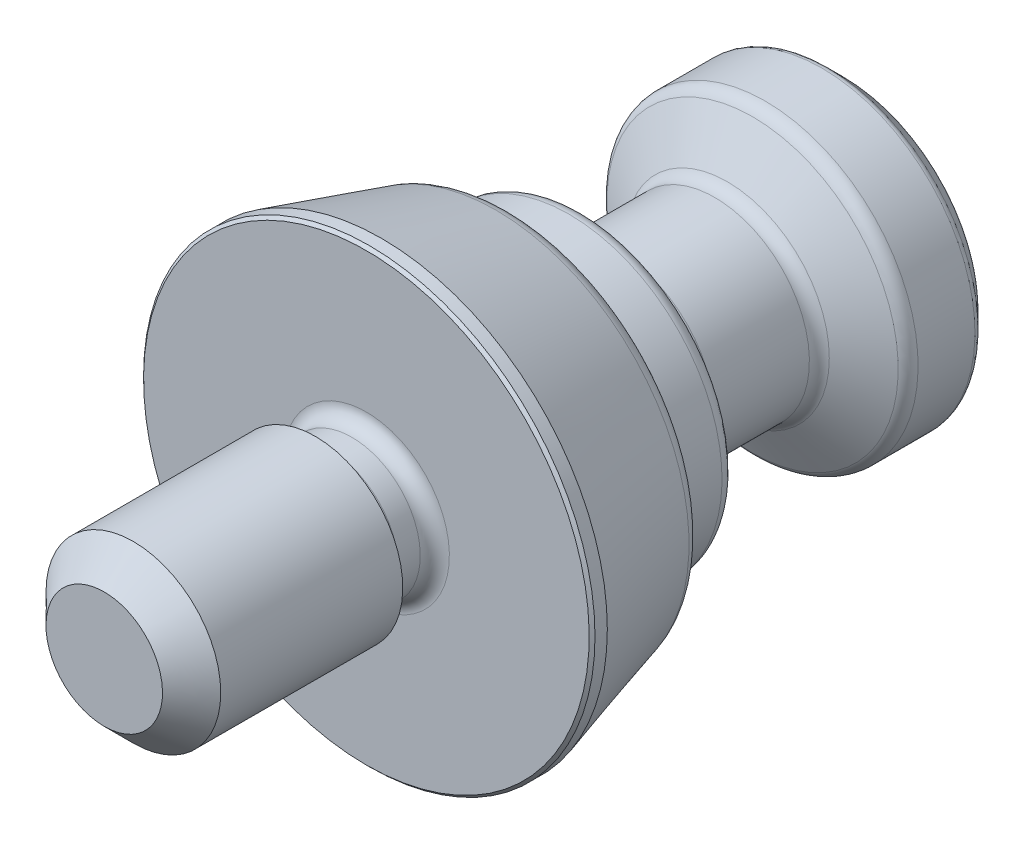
ISO-10303-21;
HEADER;
FILE_DESCRIPTION(('STEP AP214'),'2;1');
FILE_NAME('part.step','',(''),(''),'','','');
FILE_SCHEMA(('AUTOMOTIVE_DESIGN { 1 0 10303 214 1 1 1 1 }'));
ENDSEC;
DATA;
#1=APPLICATION_CONTEXT('core data for automotive mechanical design processes');
#2=APPLICATION_PROTOCOL_DEFINITION('international standard','automotive_design',2000,#1);
#3=PRODUCT_CONTEXT('',#1,'mechanical');
#4=PRODUCT('Part','Part','',(#3));
#5=PRODUCT_RELATED_PRODUCT_CATEGORY('part','',(#4));
#6=PRODUCT_DEFINITION_FORMATION('','',#4);
#7=PRODUCT_DEFINITION_CONTEXT('part definition',#1,'design');
#8=PRODUCT_DEFINITION('design','',#6,#7);
#9=PRODUCT_DEFINITION_SHAPE('','',#8);
#10=(LENGTH_UNIT() NAMED_UNIT(*) SI_UNIT(.MILLI.,.METRE.));
#11=(NAMED_UNIT(*) PLANE_ANGLE_UNIT() SI_UNIT($,.RADIAN.));
#12=(NAMED_UNIT(*) SI_UNIT($,.STERADIAN.) SOLID_ANGLE_UNIT());
#13=UNCERTAINTY_MEASURE_WITH_UNIT(LENGTH_MEASURE(1.E-05),#10,'distance_accuracy_value','');
#14=(GEOMETRIC_REPRESENTATION_CONTEXT(3) GLOBAL_UNCERTAINTY_ASSIGNED_CONTEXT((#13)) GLOBAL_UNIT_ASSIGNED_CONTEXT((#10,
#11,#12)) REPRESENTATION_CONTEXT('',''));
#15=CARTESIAN_POINT('',(0.,0.,0.));
#16=DIRECTION('',(0.,0.,1.));
#17=DIRECTION('',(1.,0.,0.));
#18=AXIS2_PLACEMENT_3D('',#15,#16,#17);
#19=CARTESIAN_POINT('',(3.46410161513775,0.,-28.5));
#20=DIRECTION('',(0.,0.,-1.));
#21=DIRECTION('',(0.,1.,0.));
#22=AXIS2_PLACEMENT_3D('',#19,#20,#21);
#23=PLANE('',#22);
#24=DIRECTION('',(-1.,0.,0.));
#25=VECTOR('',#24,1.);
#26=CARTESIAN_POINT('',(1.73205080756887,-3.,-28.5));
#27=LINE('',#26,#25);
#28=CARTESIAN_POINT('',(1.73205080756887,-3.,-28.5));
#29=VERTEX_POINT('',#28);
#30=CARTESIAN_POINT('',(0.,-3.,-28.5));
#31=VERTEX_POINT('',#30);
#32=EDGE_CURVE('E216',#29,#31,#27,.T.);
#33=ORIENTED_EDGE('',*,*,#32,.T.);
#34=CARTESIAN_POINT('',(0.,0.,-28.5));
#35=DIRECTION('',(0.,0.,1.));
#36=DIRECTION('',(0.,-1.,0.));
#37=AXIS2_PLACEMENT_3D('',#34,#35,#36);
#38=CIRCLE('',#37,3.);
#39=CARTESIAN_POINT('',(2.59807621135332,-1.5,-28.5));
#40=VERTEX_POINT('',#39);
#41=EDGE_CURVE('E29',#31,#40,#38,.T.);
#42=ORIENTED_EDGE('',*,*,#41,.T.);
#43=DIRECTION('',(-0.5,-0.866025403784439,0.));
#44=VECTOR('',#43,1.);
#45=CARTESIAN_POINT('',(3.46410161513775,0.,-28.5));
#46=LINE('',#45,#44);
#47=EDGE_CURVE('E440',#40,#29,#46,.T.);
#48=ORIENTED_EDGE('',*,*,#47,.T.);
#49=EDGE_LOOP('',(#33,#42,#48));
#50=FACE_BOUND('',#49,.T.);
#51=ADVANCED_FACE('F14',(#50),#23,.T.);
#52=CARTESIAN_POINT('',(3.46410161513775,0.,-28.5));
#53=VERTEX_POINT('',#52);
#54=EDGE_CURVE('E441',#53,#40,#46,.T.);
#55=ORIENTED_EDGE('',*,*,#54,.T.);
#56=CARTESIAN_POINT('',(2.59807621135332,1.5,-28.5));
#57=VERTEX_POINT('',#56);
#58=EDGE_CURVE('E103',#40,#57,#38,.T.);
#59=ORIENTED_EDGE('',*,*,#58,.T.);
#60=DIRECTION('',(0.5,-0.866025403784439,0.));
#61=VECTOR('',#60,1.);
#62=CARTESIAN_POINT('',(1.73205080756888,3.,-28.5));
#63=LINE('',#62,#61);
#64=EDGE_CURVE('E436',#57,#53,#63,.T.);
#65=ORIENTED_EDGE('',*,*,#64,.T.);
#66=EDGE_LOOP('',(#55,#59,#65));
#67=FACE_BOUND('',#66,.T.);
#68=ADVANCED_FACE('F178',(#67),#23,.T.);
#69=CARTESIAN_POINT('',(1.73205080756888,3.,-28.5));
#70=VERTEX_POINT('',#69);
#71=EDGE_CURVE('E437',#70,#57,#63,.T.);
#72=ORIENTED_EDGE('',*,*,#71,.T.);
#73=CARTESIAN_POINT('',(0.,3.,-28.5));
#74=VERTEX_POINT('',#73);
#75=EDGE_CURVE('E461',#57,#74,#38,.T.);
#76=ORIENTED_EDGE('',*,*,#75,.T.);
#77=DIRECTION('',(1.,0.,0.));
#78=VECTOR('',#77,1.);
#79=CARTESIAN_POINT('',(-1.73205080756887,3.,-28.5));
#80=LINE('',#79,#78);
#81=EDGE_CURVE('E221',#74,#70,#80,.T.);
#82=ORIENTED_EDGE('',*,*,#81,.T.);
#83=EDGE_LOOP('',(#72,#76,#82));
#84=FACE_BOUND('',#83,.T.);
#85=ADVANCED_FACE('F185',(#84),#23,.T.);
#86=CARTESIAN_POINT('',(-1.73205080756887,3.,-28.5));
#87=VERTEX_POINT('',#86);
#88=EDGE_CURVE('E222',#87,#74,#80,.T.);
#89=ORIENTED_EDGE('',*,*,#88,.T.);
#90=CARTESIAN_POINT('',(-2.59807621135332,1.5,-28.5));
#91=VERTEX_POINT('',#90);
#92=EDGE_CURVE('E460',#74,#91,#38,.T.);
#93=ORIENTED_EDGE('',*,*,#92,.T.);
#94=DIRECTION('',(0.5,0.866025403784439,0.));
#95=VECTOR('',#94,1.);
#96=CARTESIAN_POINT('',(-3.46410161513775,0.,-28.5));
#97=LINE('',#96,#95);
#98=EDGE_CURVE('E211',#91,#87,#97,.T.);
#99=ORIENTED_EDGE('',*,*,#98,.T.);
#100=EDGE_LOOP('',(#89,#93,#99));
#101=FACE_BOUND('',#100,.T.);
#102=ADVANCED_FACE('F200',(#101),#23,.T.);
#103=CARTESIAN_POINT('',(-3.46410161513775,0.,-28.5));
#104=VERTEX_POINT('',#103);
#105=EDGE_CURVE('E214',#104,#91,#97,.T.);
#106=ORIENTED_EDGE('',*,*,#105,.T.);
#107=CARTESIAN_POINT('',(-2.59807621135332,-1.5,-28.5));
#108=VERTEX_POINT('',#107);
#109=EDGE_CURVE('E458',#91,#108,#38,.T.);
#110=ORIENTED_EDGE('',*,*,#109,.T.);
#111=DIRECTION('',(-0.5,0.866025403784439,0.));
#112=VECTOR('',#111,1.);
#113=CARTESIAN_POINT('',(-1.73205080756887,-3.,-28.5));
#114=LINE('',#113,#112);
#115=EDGE_CURVE('E212',#108,#104,#114,.T.);
#116=ORIENTED_EDGE('',*,*,#115,.T.);
#117=EDGE_LOOP('',(#106,#110,#116));
#118=FACE_BOUND('',#117,.T.);
#119=ADVANCED_FACE('F191',(#118),#23,.T.);
#120=CARTESIAN_POINT('',(-1.73205080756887,-3.,-28.5));
#121=VERTEX_POINT('',#120);
#122=EDGE_CURVE('E204',#121,#108,#114,.T.);
#123=ORIENTED_EDGE('',*,*,#122,.T.);
#124=EDGE_CURVE('E104',#108,#31,#38,.T.);
#125=ORIENTED_EDGE('',*,*,#124,.T.);
#126=EDGE_CURVE('E206',#31,#121,#27,.T.);
#127=ORIENTED_EDGE('',*,*,#126,.T.);
#128=EDGE_LOOP('',(#123,#125,#127));
#129=FACE_BOUND('',#128,.T.);
#130=ADVANCED_FACE('F181',(#129),#23,.T.);
#131=CARTESIAN_POINT('',(10.5005,0.,-33.));
#132=DIRECTION('',(0.,0.,-1.));
#133=DIRECTION('',(0.,1.,0.));
#134=AXIS2_PLACEMENT_3D('',#131,#132,#133);
#135=PLANE('',#134);
#136=CARTESIAN_POINT('',(0.,0.,-33.));
#137=DIRECTION('',(0.,0.,-1.));
#138=DIRECTION('',(0.,1.,0.));
#139=AXIS2_PLACEMENT_3D('',#136,#137,#138);
#140=CIRCLE('',#139,8.58578643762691);
#141=CARTESIAN_POINT('',(0.,8.58578643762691,-33.));
#142=VERTEX_POINT('',#141);
#143=EDGE_CURVE('E269',#142,#142,#140,.T.);
#144=ORIENTED_EDGE('',*,*,#143,.T.);
#145=EDGE_LOOP('',(#144));
#146=FACE_BOUND('',#145,.T.);
#147=CARTESIAN_POINT('',(0.,0.,-33.));
#148=DIRECTION('',(0.,0.,1.));
#149=DIRECTION('',(0.,-1.,0.));
#150=AXIS2_PLACEMENT_3D('',#147,#148,#149);
#151=CIRCLE('',#150,3.75);
#152=CARTESIAN_POINT('',(0.,-3.75,-33.));
#153=VERTEX_POINT('',#152);
#154=EDGE_CURVE('E96',#153,#153,#151,.T.);
#155=ORIENTED_EDGE('',*,*,#154,.T.);
#156=EDGE_LOOP('',(#155));
#157=FACE_BOUND('',#156,.T.);
#158=ADVANCED_FACE('F190',(#146,#157),#135,.T.);
#159=CARTESIAN_POINT('',(0.,0.,0.));
#160=DIRECTION('',(0.,0.,1.));
#161=DIRECTION('',(0.,-1.,0.));
#162=AXIS2_PLACEMENT_3D('',#159,#160,#161);
#163=CYLINDRICAL_SURFACE('',#162,10.5);
#164=CARTESIAN_POINT('',(0.,0.,-27.3867513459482));
#165=DIRECTION('',(0.,0.,-1.));
#166=DIRECTION('',(0.,1.,0.));
#167=AXIS2_PLACEMENT_3D('',#164,#165,#166);
#168=CIRCLE('',#167,10.5);
#169=CARTESIAN_POINT('',(0.,10.5,-27.3867513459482));
#170=VERTEX_POINT('',#169);
#171=EDGE_CURVE('E293',#170,#170,#168,.T.);
#172=ORIENTED_EDGE('',*,*,#171,.T.);
#173=EDGE_LOOP('',(#172));
#174=FACE_BOUND('',#173,.T.);
#175=CARTESIAN_POINT('',(0.,0.,-31.2928932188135));
#176=DIRECTION('',(0.,0.,-1.));
#177=DIRECTION('',(0.,1.,0.));
#178=AXIS2_PLACEMENT_3D('',#175,#176,#177);
#179=CIRCLE('',#178,10.5);
#180=CARTESIAN_POINT('',(0.,10.5,-31.2928932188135));
#181=VERTEX_POINT('',#180);
#182=EDGE_CURVE('E254',#181,#181,#179,.F.);
#183=ORIENTED_EDGE('',*,*,#182,.T.);
#184=EDGE_LOOP('',(#183));
#185=FACE_BOUND('',#184,.T.);
#186=ADVANCED_FACE('F197',(#174,#185),#163,.T.);
#187=CARTESIAN_POINT('',(0.,0.,0.));
#188=DIRECTION('',(0.,0.,-1.));
#189=DIRECTION('',(0.,1.,0.));
#190=AXIS2_PLACEMENT_3D('',#187,#188,#189);
#191=CYLINDRICAL_SURFACE('',#190,10.5005);
#192=CARTESIAN_POINT('',(0.,0.,-10.4));
#193=DIRECTION('',(0.,0.,-1.));
#194=DIRECTION('',(0.,1.,0.));
#195=AXIS2_PLACEMENT_3D('',#192,#193,#194);
#196=CIRCLE('',#195,10.5005);
#197=CARTESIAN_POINT('',(0.,10.5005,-10.4));
#198=VERTEX_POINT('',#197);
#199=EDGE_CURVE('E9',#198,#198,#196,.T.);
#200=ORIENTED_EDGE('',*,*,#199,.T.);
#201=EDGE_LOOP('',(#200));
#202=FACE_BOUND('',#201,.T.);
#203=CARTESIAN_POINT('',(0.,0.,-13.9226497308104));
#204=DIRECTION('',(0.,0.,-1.));
#205=DIRECTION('',(0.,1.,0.));
#206=AXIS2_PLACEMENT_3D('',#203,#204,#205);
#207=CIRCLE('',#206,10.5005);
#208=CARTESIAN_POINT('',(0.,10.5005,-13.9226497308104));
#209=VERTEX_POINT('',#208);
#210=EDGE_CURVE('E284',#209,#209,#207,.F.);
#211=ORIENTED_EDGE('',*,*,#210,.T.);
#212=EDGE_LOOP('',(#211));
#213=FACE_BOUND('',#212,.T.);
#214=ADVANCED_FACE('F323',(#202,#213),#191,.T.);
#215=CARTESIAN_POINT('',(0.,0.,0.));
#216=DIRECTION('',(0.,0.,1.));
#217=DIRECTION('',(0.,-1.,0.));
#218=AXIS2_PLACEMENT_3D('',#215,#216,#217);
#219=CYLINDRICAL_SURFACE('',#218,6.5);
#220=CARTESIAN_POINT('',(0.,0.,-23.9226497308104));
#221=DIRECTION('',(0.,0.,1.));
#222=DIRECTION('',(0.,-1.,0.));
#223=AXIS2_PLACEMENT_3D('',#220,#221,#222);
#224=CIRCLE('',#223,6.5);
#225=CARTESIAN_POINT('',(0.,-6.5,-23.9226497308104));
#226=VERTEX_POINT('',#225);
#227=EDGE_CURVE('E245',#226,#226,#224,.T.);
#228=ORIENTED_EDGE('',*,*,#227,.T.);
#229=EDGE_LOOP('',(#228));
#230=FACE_BOUND('',#229,.T.);
#231=CARTESIAN_POINT('',(0.,0.,-17.3870400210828));
#232=DIRECTION('',(0.,0.,1.));
#233=DIRECTION('',(0.,-1.,0.));
#234=AXIS2_PLACEMENT_3D('',#231,#232,#233);
#235=CIRCLE('',#234,6.5);
#236=CARTESIAN_POINT('',(0.,-6.5,-17.3870400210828));
#237=VERTEX_POINT('',#236);
#238=EDGE_CURVE('E229',#237,#237,#235,.F.);
#239=ORIENTED_EDGE('',*,*,#238,.T.);
#240=EDGE_LOOP('',(#239));
#241=FACE_BOUND('',#240,.T.);
#242=ADVANCED_FACE('F326',(#230,#241),#219,.T.);
#243=CARTESIAN_POINT('',(0.,0.,-24.5));
#244=DIRECTION('',(0.,0.,-1.));
#245=DIRECTION('',(0.,1.,0.));
#246=AXIS2_PLACEMENT_3D('',#243,#244,#245);
#247=CONICAL_SURFACE('',#246,6.5,1.0471975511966);
#248=CARTESIAN_POINT('',(0.,0.,-26.5207259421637));
#249=DIRECTION('',(0.,0.,1.));
#250=DIRECTION('',(0.,-1.,0.));
#251=AXIS2_PLACEMENT_3D('',#248,#249,#250);
#252=CIRCLE('',#251,10.);
#253=CARTESIAN_POINT('',(0.,-10.,-26.5207259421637));
#254=VERTEX_POINT('',#253);
#255=EDGE_CURVE('E290',#254,#254,#252,.T.);
#256=ORIENTED_EDGE('',*,*,#255,.T.);
#257=EDGE_LOOP('',(#256));
#258=FACE_BOUND('',#257,.T.);
#259=CARTESIAN_POINT('',(0.,0.,-24.7886751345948));
#260=DIRECTION('',(0.,0.,-1.));
#261=DIRECTION('',(0.,1.,0.));
#262=AXIS2_PLACEMENT_3D('',#259,#260,#261);
#263=CIRCLE('',#262,7.);
#264=CARTESIAN_POINT('',(0.,7.,-24.7886751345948));
#265=VERTEX_POINT('',#264);
#266=EDGE_CURVE('E248',#265,#265,#263,.T.);
#267=ORIENTED_EDGE('',*,*,#266,.T.);
#268=EDGE_LOOP('',(#267));
#269=FACE_BOUND('',#268,.T.);
#270=ADVANCED_FACE('F539',(#258,#269),#247,.T.);
#271=CARTESIAN_POINT('',(0.,0.,-14.5));
#272=DIRECTION('',(0.,0.,1.));
#273=DIRECTION('',(0.,-1.,0.));
#274=AXIS2_PLACEMENT_3D('',#271,#272,#273);
#275=CONICAL_SURFACE('',#274,10.5005,1.0471975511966);
#276=CARTESIAN_POINT('',(0.,0.,-14.7886751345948));
#277=DIRECTION('',(0.,0.,-1.));
#278=DIRECTION('',(0.,1.,0.));
#279=AXIS2_PLACEMENT_3D('',#276,#277,#278);
#280=CIRCLE('',#279,10.0005);
#281=CARTESIAN_POINT('',(0.,10.0005,-14.7886751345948));
#282=VERTEX_POINT('',#281);
#283=EDGE_CURVE('E287',#282,#282,#280,.T.);
#284=ORIENTED_EDGE('',*,*,#283,.T.);
#285=EDGE_LOOP('',(#284));
#286=FACE_BOUND('',#285,.T.);
#287=CARTESIAN_POINT('',(0.,0.,-16.5210146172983));
#288=DIRECTION('',(0.,0.,1.));
#289=DIRECTION('',(0.,-1.,0.));
#290=AXIS2_PLACEMENT_3D('',#287,#288,#289);
#291=CIRCLE('',#290,7.);
#292=CARTESIAN_POINT('',(0.,-7.,-16.5210146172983));
#293=VERTEX_POINT('',#292);
#294=EDGE_CURVE('E251',#293,#293,#291,.T.);
#295=ORIENTED_EDGE('',*,*,#294,.T.);
#296=EDGE_LOOP('',(#295));
#297=FACE_BOUND('',#296,.T.);
#298=ADVANCED_FACE('F547',(#286,#297),#275,.T.);
#299=CARTESIAN_POINT('',(0.,0.,-31.5));
#300=DIRECTION('',(0.,0.,1.));
#301=DIRECTION('',(0.,-1.,0.));
#302=AXIS2_PLACEMENT_3D('',#299,#300,#301);
#303=CONICAL_SURFACE('',#302,10.5,0.785398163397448);
#304=CARTESIAN_POINT('',(0.,0.,-32.7071067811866));
#305=DIRECTION('',(0.,0.,-1.));
#306=DIRECTION('',(0.,1.,0.));
#307=AXIS2_PLACEMENT_3D('',#304,#305,#306);
#308=CIRCLE('',#307,9.29289321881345);
#309=CARTESIAN_POINT('',(0.,9.29289321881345,-32.7071067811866));
#310=VERTEX_POINT('',#309);
#311=EDGE_CURVE('E266',#310,#310,#308,.F.);
#312=ORIENTED_EDGE('',*,*,#311,.T.);
#313=EDGE_LOOP('',(#312));
#314=FACE_BOUND('',#313,.T.);
#315=CARTESIAN_POINT('',(0.,0.,-31.6464466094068));
#316=DIRECTION('',(0.,0.,-1.));
#317=DIRECTION('',(0.,1.,0.));
#318=AXIS2_PLACEMENT_3D('',#315,#316,#317);
#319=CIRCLE('',#318,10.3535533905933);
#320=CARTESIAN_POINT('',(0.,10.3535533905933,-31.6464466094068));
#321=VERTEX_POINT('',#320);
#322=EDGE_CURVE('E257',#321,#321,#319,.T.);
#323=ORIENTED_EDGE('',*,*,#322,.T.);
#324=EDGE_LOOP('',(#323));
#325=FACE_BOUND('',#324,.T.);
#326=ADVANCED_FACE('F401',(#314,#325),#303,.T.);
#327=CARTESIAN_POINT('',(0.,0.,-23.9226497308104));
#328=DIRECTION('',(0.,0.,1.));
#329=DIRECTION('',(0.,-1.,0.));
#330=AXIS2_PLACEMENT_3D('',#327,#328,#329);
#331=TOROIDAL_SURFACE('',#330,7.5,1.);
#332=ORIENTED_EDGE('',*,*,#266,.F.);
#333=EDGE_LOOP('',(#332));
#334=FACE_BOUND('',#333,.T.);
#335=ORIENTED_EDGE('',*,*,#227,.F.);
#336=EDGE_LOOP('',(#335));
#337=FACE_BOUND('',#336,.T.);
#338=ADVANCED_FACE('F397',(#334,#337),#331,.F.);
#339=CARTESIAN_POINT('',(0.,0.,-17.3870400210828));
#340=DIRECTION('',(0.,0.,1.));
#341=DIRECTION('',(0.,-1.,0.));
#342=AXIS2_PLACEMENT_3D('',#339,#340,#341);
#343=TOROIDAL_SURFACE('',#342,7.5,1.);
#344=ORIENTED_EDGE('',*,*,#238,.F.);
#345=EDGE_LOOP('',(#344));
#346=FACE_BOUND('',#345,.T.);
#347=ORIENTED_EDGE('',*,*,#294,.F.);
#348=EDGE_LOOP('',(#347));
#349=FACE_BOUND('',#348,.T.);
#350=ADVANCED_FACE('F400',(#346,#349),#343,.F.);
#351=CARTESIAN_POINT('',(0.,0.,-31.2928932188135));
#352=DIRECTION('',(0.,0.,-1.));
#353=DIRECTION('',(0.,1.,0.));
#354=AXIS2_PLACEMENT_3D('',#351,#352,#353);
#355=TOROIDAL_SURFACE('',#354,10.,0.5);
#356=ORIENTED_EDGE('',*,*,#322,.F.);
#357=EDGE_LOOP('',(#356));
#358=FACE_BOUND('',#357,.T.);
#359=ORIENTED_EDGE('',*,*,#182,.F.);
#360=EDGE_LOOP('',(#359));
#361=FACE_BOUND('',#360,.T.);
#362=ADVANCED_FACE('F405',(#358,#361),#355,.T.);
#363=CARTESIAN_POINT('',(0.,0.,-32.));
#364=DIRECTION('',(0.,0.,-1.));
#365=DIRECTION('',(0.,1.,0.));
#366=AXIS2_PLACEMENT_3D('',#363,#364,#365);
#367=TOROIDAL_SURFACE('',#366,8.58578643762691,1.);
#368=ORIENTED_EDGE('',*,*,#143,.F.);
#369=EDGE_LOOP('',(#368));
#370=FACE_BOUND('',#369,.T.);
#371=ORIENTED_EDGE('',*,*,#311,.F.);
#372=EDGE_LOOP('',(#371));
#373=FACE_BOUND('',#372,.T.);
#374=ADVANCED_FACE('F129',(#370,#373),#367,.T.);
#375=CARTESIAN_POINT('',(0.,0.,-33.));
#376=DIRECTION('',(0.,0.,-1.));
#377=DIRECTION('',(0.,1.,0.));
#378=AXIS2_PLACEMENT_3D('',#375,#376,#377);
#379=CONICAL_SURFACE('',#378,3.75,1.0471975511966);
#380=ORIENTED_EDGE('',*,*,#154,.F.);
#381=EDGE_LOOP('',(#380));
#382=FACE_BOUND('',#381,.T.);
#383=CARTESIAN_POINT('',(1.73193533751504,-3.0002,-32.8350031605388));
#384=CARTESIAN_POINT('',(1.80805042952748,-2.86836479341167,-32.7910410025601));
#385=CARTESIAN_POINT('',(1.88482254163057,-2.73539159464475,-32.7510588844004));
#386=CARTESIAN_POINT('',(2.03969618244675,-2.46714257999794,-32.6812693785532));
#387=CARTESIAN_POINT('',(2.11780046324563,-2.33186199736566,-32.6514866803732));
#388=CARTESIAN_POINT('',(2.27304105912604,-2.06297739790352,-32.605125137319));
#389=CARTESIAN_POINT('',(2.35015348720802,-1.92941475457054,-32.5882377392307));
#390=CARTESIAN_POINT('',(2.50474122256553,-1.66166094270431,-32.5680769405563));
#391=CARTESIAN_POINT('',(2.58221596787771,-1.52747074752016,-32.5647868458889));
#392=CARTESIAN_POINT('',(2.72698443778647,-1.27672440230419,-32.5716278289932));
#393=CARTESIAN_POINT('',(2.79429982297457,-1.16013073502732,-32.5800792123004));
#394=CARTESIAN_POINT('',(2.92849202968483,-0.927703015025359,-32.6068662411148));
#395=CARTESIAN_POINT('',(2.99536838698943,-0.811869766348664,-32.6252110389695));
#396=CARTESIAN_POINT('',(3.12983731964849,-0.578962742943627,-32.6710720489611));
#397=CARTESIAN_POINT('',(3.19741287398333,-0.461918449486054,-32.6987826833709));
#398=CARTESIAN_POINT('',(3.33155605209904,-0.229575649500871,-32.7616750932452));
#399=CARTESIAN_POINT('',(3.39812539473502,-0.11427416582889,-32.7968420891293));
#400=CARTESIAN_POINT('',(3.4642170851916,0.000200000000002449,-32.8350031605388));
#401=B_SPLINE_CURVE_WITH_KNOTS('',3,(#383,#384,#385,#386,#387,#388,#389,#390,#391,#392,#393,
#394,#395,#396,#397,#398,#399,#400),.UNSPECIFIED.,.F.,.F.,(4,2,2,2,2,2,2,2,4),(0.,
0.475539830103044,0.952222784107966,1.41710776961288,1.88142182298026,2.28572436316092,
2.6904015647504,3.10405572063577,3.51689749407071),.UNSPECIFIED.);
#402=CARTESIAN_POINT('',(1.73205080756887,-3.,-32.8349364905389));
#403=VERTEX_POINT('',#402);
#404=CARTESIAN_POINT('',(3.46410161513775,0.,-32.8349364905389));
#405=VERTEX_POINT('',#404);
#406=EDGE_CURVE('E37',#403,#405,#401,.T.);
#407=ORIENTED_EDGE('',*,*,#406,.T.);
#408=CARTESIAN_POINT('',(3.4642170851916,-0.000199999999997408,-32.8350031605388));
#409=CARTESIAN_POINT('',(3.38810199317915,0.131635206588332,-32.7910410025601));
#410=CARTESIAN_POINT('',(3.31132988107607,0.26460840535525,-32.7510588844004));
#411=CARTESIAN_POINT('',(3.15645624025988,0.532857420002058,-32.6812693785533));
#412=CARTESIAN_POINT('',(3.078351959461,0.668138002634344,-32.6514866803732));
#413=CARTESIAN_POINT('',(2.92311136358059,0.937022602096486,-32.605125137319));
#414=CARTESIAN_POINT('',(2.84599893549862,1.07058524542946,-32.5882377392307));
#415=CARTESIAN_POINT('',(2.6914112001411,1.3383390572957,-32.5680769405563));
#416=CARTESIAN_POINT('',(2.61393645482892,1.47252925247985,-32.5647868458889));
#417=CARTESIAN_POINT('',(2.46916798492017,1.72327559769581,-32.5716278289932));
#418=CARTESIAN_POINT('',(2.40185259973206,1.83986926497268,-32.5800792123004));
#419=CARTESIAN_POINT('',(2.2676603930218,2.07229698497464,-32.6068662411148));
#420=CARTESIAN_POINT('',(2.2007840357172,2.18813023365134,-32.6252110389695));
#421=CARTESIAN_POINT('',(2.06631510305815,2.42103725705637,-32.6710720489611));
#422=CARTESIAN_POINT('',(1.99873954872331,2.53808155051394,-32.6987826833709));
#423=CARTESIAN_POINT('',(1.86459637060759,2.77042435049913,-32.7616750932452));
#424=CARTESIAN_POINT('',(1.79802702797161,2.88572583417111,-32.7968420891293));
#425=CARTESIAN_POINT('',(1.73193533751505,3.0002,-32.8350031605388));
#426=B_SPLINE_CURVE_WITH_KNOTS('',3,(#408,#409,#410,#411,#412,#413,#414,#415,#416,#417,#418,
#419,#420,#421,#422,#423,#424,#425),.UNSPECIFIED.,.F.,.F.,(4,2,2,2,2,2,2,2,4),(0.,
0.475539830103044,0.952222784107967,1.41710776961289,1.88142182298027,2.28572436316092,
2.69040156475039,3.10405572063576,3.5168974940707),.UNSPECIFIED.);
#427=CARTESIAN_POINT('',(1.73205080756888,3.,-32.8349364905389));
#428=VERTEX_POINT('',#427);
#429=EDGE_CURVE('E99',#405,#428,#426,.T.);
#430=ORIENTED_EDGE('',*,*,#429,.T.);
#431=CARTESIAN_POINT('',(-4.57816394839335,3.,-33.9950833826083));
#432=CARTESIAN_POINT('',(-4.44770534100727,3.,-33.9321019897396));
#433=CARTESIAN_POINT('',(-4.3169390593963,3.,-33.8697465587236));
#434=CARTESIAN_POINT('',(-4.05462715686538,3.,-33.7466413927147));
#435=CARTESIAN_POINT('',(-3.92308140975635,3.,-33.6858919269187));
#436=CARTESIAN_POINT('',(-3.65833272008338,3.,-33.5660308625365));
#437=CARTESIAN_POINT('',(-3.52512459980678,3.,-33.5069306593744));
#438=CARTESIAN_POINT('',(-3.2576220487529,3.,-33.3912515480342));
#439=CARTESIAN_POINT('',(-3.12332767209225,3.,-33.3346725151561));
#440=CARTESIAN_POINT('',(-2.84947160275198,3.,-33.2230876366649));
#441=CARTESIAN_POINT('',(-2.70987100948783,3.,-33.168176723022));
#442=CARTESIAN_POINT('',(-2.42900957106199,3.,-33.0626937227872));
#443=CARTESIAN_POINT('',(-2.28774853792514,3.,-33.0121221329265));
#444=CARTESIAN_POINT('',(-2.00363062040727,3.,-32.9166996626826));
#445=CARTESIAN_POINT('',(-1.86077789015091,3.,-32.871836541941));
#446=CARTESIAN_POINT('',(-1.57302582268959,3.,-32.789318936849));
#447=CARTESIAN_POINT('',(-1.4281271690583,3.,-32.7516621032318));
#448=CARTESIAN_POINT('',(-1.13695389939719,3.,-32.6855990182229));
#449=CARTESIAN_POINT('',(-0.990689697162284,3.,-32.657147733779));
#450=CARTESIAN_POINT('',(-0.696423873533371,3.,-32.6111671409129));
#451=CARTESIAN_POINT('',(-0.548422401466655,3.,-32.5936369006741));
#452=CARTESIAN_POINT('',(-0.253322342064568,3.,-32.5711271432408));
#453=CARTESIAN_POINT('',(-0.106235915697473,3.,-32.5659920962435));
#454=CARTESIAN_POINT('',(0.18784914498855,3.,-32.568302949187));
#455=CARTESIAN_POINT('',(0.334847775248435,3.,-32.5757493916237));
#456=CARTESIAN_POINT('',(0.586621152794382,3.,-32.5987632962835));
#457=CARTESIAN_POINT('',(0.691671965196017,3.,-32.6114663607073));
#458=CARTESIAN_POINT('',(0.900950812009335,3.,-32.6424661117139));
#459=CARTESIAN_POINT('',(1.00517872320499,3.,-32.6607636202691));
#460=CARTESIAN_POINT('',(1.316515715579,3.,-32.7230802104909));
#461=CARTESIAN_POINT('',(1.52215497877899,3.,-32.7745106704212));
#462=CARTESIAN_POINT('',(1.82965945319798,3.,-32.8630327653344));
#463=CARTESIAN_POINT('',(1.93313257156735,3.,-32.8948509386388));
#464=CARTESIAN_POINT('',(2.13907223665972,3.,-32.9616217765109));
#465=CARTESIAN_POINT('',(2.24153877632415,3.,-32.9965744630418));
#466=CARTESIAN_POINT('',(2.4455023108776,3.,-33.0690674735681));
#467=CARTESIAN_POINT('',(2.54699964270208,3.,-33.1066068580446));
#468=CARTESIAN_POINT('',(2.74916366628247,3.,-33.1838485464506));
#469=CARTESIAN_POINT('',(2.84983037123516,3.,-33.2235508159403));
#470=CARTESIAN_POINT('',(3.10285866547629,3.,-33.325976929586));
#471=CARTESIAN_POINT('',(3.25473921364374,3.,-33.3898874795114));
#472=CARTESIAN_POINT('',(3.55712311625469,3.,-33.5208972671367));
#473=CARTESIAN_POINT('',(3.70762636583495,3.,-33.587996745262));
#474=CARTESIAN_POINT('',(4.00754037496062,3.,-33.7246828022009));
#475=CARTESIAN_POINT('',(4.15695085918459,3.,-33.7942699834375));
#476=CARTESIAN_POINT('',(4.45485069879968,3.,-33.9353919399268));
#477=CARTESIAN_POINT('',(4.60334003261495,3.,-34.0069267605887));
#478=CARTESIAN_POINT('',(5.04803783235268,3.,-34.224009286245));
#479=CARTESIAN_POINT('',(5.34311674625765,3.,-34.3718687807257));
#480=CARTESIAN_POINT('',(5.93116502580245,3.,-34.6715928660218));
#481=CARTESIAN_POINT('',(6.22413469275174,3.,-34.823456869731));
#482=CARTESIAN_POINT('',(6.78142028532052,3.,-35.1157233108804));
#483=CARTESIAN_POINT('',(7.0458664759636,3.,-35.2558777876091));
#484=CARTESIAN_POINT('',(7.57386151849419,3.,-35.5378914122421));
#485=CARTESIAN_POINT('',(7.83741033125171,3.,-35.67975063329));
#486=CARTESIAN_POINT('',(8.36311374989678,3.,-35.9643722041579));
#487=CARTESIAN_POINT('',(8.62527019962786,3.,-36.1071311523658));
#488=CARTESIAN_POINT('',(9.14901852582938,3.,-36.3936442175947));
#489=CARTESIAN_POINT('',(9.4106104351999,3.,-36.5373982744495));
#490=CARTESIAN_POINT('',(9.67199904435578,3.,-36.6815185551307));
#491=B_SPLINE_CURVE_WITH_KNOTS('',3,(#431,#432,#433,#434,#435,#436,#437,#438,#439,#440,#441,
#442,#443,#444,#445,#446,#447,#448,#449,#450,#451,#452,#453,#454,#455,#456,#457,#458,#459,#460,
#461,#462,#463,#464,#465,#466,#467,#468,#469,#470,#471,#472,#473,#474,#475,#476,#477,#478,#479,
#480,#481,#482,#483,#484,#485,#486,#487,#488,#489,#490),.UNSPECIFIED.,.F.,.F.,(4,2,2,2,2,2,2,2,
2,2,2,2,2,2,2,2,2,2,2,2,2,2,2,2,2,2,2,2,2,4),(0.,0.434603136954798,0.86927866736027,
1.3064478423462,1.74359537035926,2.19357500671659,2.64360608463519,3.09265531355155,
3.54155790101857,3.98823005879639,4.43486409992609,4.87586414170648,5.31688319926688,
5.63417619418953,5.9515158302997,6.58656462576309,6.91130347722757,7.23604460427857,
7.56066839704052,7.88528702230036,8.37957333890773,8.87389698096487,9.3683411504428,
9.86279685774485,10.8528958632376,11.842850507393,12.7407149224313,13.6386179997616,
14.5341350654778,15.4295984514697),.UNSPECIFIED.);
#492=CARTESIAN_POINT('',(-1.73205080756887,3.,-32.8349364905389));
#493=VERTEX_POINT('',#492);
#494=EDGE_CURVE('E114',#428,#493,#491,.F.);
#495=ORIENTED_EDGE('',*,*,#494,.T.);
#496=CARTESIAN_POINT('',(-1.73193533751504,3.0002,-32.8350031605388));
#497=CARTESIAN_POINT('',(-1.80805042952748,2.86836479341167,-32.7910410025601));
#498=CARTESIAN_POINT('',(-1.88482254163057,2.73539159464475,-32.7510588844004));
#499=CARTESIAN_POINT('',(-2.03969618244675,2.46714257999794,-32.6812693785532));
#500=CARTESIAN_POINT('',(-2.11780046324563,2.33186199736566,-32.6514866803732));
#501=CARTESIAN_POINT('',(-2.27304105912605,2.06297739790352,-32.605125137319));
#502=CARTESIAN_POINT('',(-2.35015348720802,1.92941475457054,-32.5882377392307));
#503=CARTESIAN_POINT('',(-2.50474122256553,1.66166094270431,-32.5680769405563));
#504=CARTESIAN_POINT('',(-2.58221596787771,1.52747074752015,-32.5647868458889));
#505=CARTESIAN_POINT('',(-2.72698443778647,1.27672440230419,-32.5716278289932));
#506=CARTESIAN_POINT('',(-2.79429982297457,1.16013073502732,-32.5800792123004));
#507=CARTESIAN_POINT('',(-2.92849202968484,0.927703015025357,-32.6068662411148));
#508=CARTESIAN_POINT('',(-2.99536838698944,0.811869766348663,-32.6252110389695));
#509=CARTESIAN_POINT('',(-3.12983731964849,0.578962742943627,-32.6710720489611));
#510=CARTESIAN_POINT('',(-3.19741287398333,0.461918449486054,-32.6987826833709));
#511=CARTESIAN_POINT('',(-3.33155605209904,0.229575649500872,-32.7616750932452));
#512=CARTESIAN_POINT('',(-3.39812539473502,0.114274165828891,-32.7968420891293));
#513=CARTESIAN_POINT('',(-3.4642170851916,-0.000200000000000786,-32.8350031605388));
#514=B_SPLINE_CURVE_WITH_KNOTS('',3,(#496,#497,#498,#499,#500,#501,#502,#503,#504,#505,#506,
#507,#508,#509,#510,#511,#512,#513),.UNSPECIFIED.,.F.,.F.,(4,2,2,2,2,2,2,2,4),(0.,
0.475539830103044,0.952222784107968,1.41710776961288,1.88142182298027,2.28572436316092,
2.6904015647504,3.10405572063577,3.51689749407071),.UNSPECIFIED.);
#515=CARTESIAN_POINT('',(-3.46410161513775,0.,-32.8349364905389));
#516=VERTEX_POINT('',#515);
#517=EDGE_CURVE('E140',#493,#516,#514,.T.);
#518=ORIENTED_EDGE('',*,*,#517,.T.);
#519=CARTESIAN_POINT('',(-3.4642170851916,0.000199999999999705,-32.8350031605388));
#520=CARTESIAN_POINT('',(-3.38810199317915,-0.13163520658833,-32.7910410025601));
#521=CARTESIAN_POINT('',(-3.31132988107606,-0.264608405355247,-32.7510588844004));
#522=CARTESIAN_POINT('',(-3.15645624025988,-0.532857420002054,-32.6812693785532));
#523=CARTESIAN_POINT('',(-3.078351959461,-0.66813800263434,-32.6514866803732));
#524=CARTESIAN_POINT('',(-2.92311136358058,-0.937022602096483,-32.605125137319));
#525=CARTESIAN_POINT('',(-2.84599893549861,-1.07058524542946,-32.5882377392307));
#526=CARTESIAN_POINT('',(-2.69141120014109,-1.33833905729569,-32.5680769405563));
#527=CARTESIAN_POINT('',(-2.61393645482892,-1.47252925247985,-32.5647868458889));
#528=CARTESIAN_POINT('',(-2.46916798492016,-1.72327559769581,-32.5716278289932));
#529=CARTESIAN_POINT('',(-2.40185259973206,-1.83986926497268,-32.5800792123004));
#530=CARTESIAN_POINT('',(-2.26766039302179,-2.07229698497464,-32.6068662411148));
#531=CARTESIAN_POINT('',(-2.20078403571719,-2.18813023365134,-32.6252110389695));
#532=CARTESIAN_POINT('',(-2.06631510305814,-2.42103725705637,-32.6710720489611));
#533=CARTESIAN_POINT('',(-1.9987395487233,-2.53808155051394,-32.6987826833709));
#534=CARTESIAN_POINT('',(-1.86459637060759,-2.77042435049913,-32.7616750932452));
#535=CARTESIAN_POINT('',(-1.79802702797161,-2.88572583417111,-32.7968420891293));
#536=CARTESIAN_POINT('',(-1.73193533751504,-3.0002,-32.8350031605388));
#537=B_SPLINE_CURVE_WITH_KNOTS('',3,(#519,#520,#521,#522,#523,#524,#525,#526,#527,#528,#529,
#530,#531,#532,#533,#534,#535,#536),.UNSPECIFIED.,.F.,.F.,(4,2,2,2,2,2,2,2,4),(0.,
0.475539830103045,0.952222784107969,1.41710776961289,1.88142182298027,2.28572436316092,
2.6904015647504,3.10405572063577,3.51689749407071),.UNSPECIFIED.);
#538=CARTESIAN_POINT('',(-1.73205080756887,-3.,-32.8349364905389));
#539=VERTEX_POINT('',#538);
#540=EDGE_CURVE('E147',#516,#539,#537,.T.);
#541=ORIENTED_EDGE('',*,*,#540,.T.);
#542=CARTESIAN_POINT('',(-4.57816394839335,-3.,-33.9950833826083));
#543=CARTESIAN_POINT('',(-4.44770534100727,-3.,-33.9321019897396));
#544=CARTESIAN_POINT('',(-4.3169390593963,-3.,-33.8697465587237));
#545=CARTESIAN_POINT('',(-4.05462715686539,-3.,-33.7466413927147));
#546=CARTESIAN_POINT('',(-3.92308140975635,-3.,-33.6858919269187));
#547=CARTESIAN_POINT('',(-3.65833272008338,-3.,-33.5660308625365));
#548=CARTESIAN_POINT('',(-3.52512459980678,-3.,-33.5069306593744));
#549=CARTESIAN_POINT('',(-3.2576220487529,-3.,-33.3912515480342));
#550=CARTESIAN_POINT('',(-3.12332767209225,-3.,-33.3346725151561));
#551=CARTESIAN_POINT('',(-2.84947160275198,-3.,-33.2230876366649));
#552=CARTESIAN_POINT('',(-2.70987100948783,-3.,-33.168176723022));
#553=CARTESIAN_POINT('',(-2.42900957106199,-3.,-33.0626937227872));
#554=CARTESIAN_POINT('',(-2.28774853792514,-3.,-33.0121221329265));
#555=CARTESIAN_POINT('',(-2.00363062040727,-3.,-32.9166996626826));
#556=CARTESIAN_POINT('',(-1.86077789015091,-3.,-32.871836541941));
#557=CARTESIAN_POINT('',(-1.57302582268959,-3.,-32.789318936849));
#558=CARTESIAN_POINT('',(-1.4281271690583,-3.,-32.7516621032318));
#559=CARTESIAN_POINT('',(-1.13695389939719,-3.,-32.6855990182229));
#560=CARTESIAN_POINT('',(-0.990689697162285,-3.,-32.657147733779));
#561=CARTESIAN_POINT('',(-0.696423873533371,-3.,-32.6111671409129));
#562=CARTESIAN_POINT('',(-0.548422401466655,-3.,-32.5936369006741));
#563=CARTESIAN_POINT('',(-0.253322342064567,-3.,-32.5711271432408));
#564=CARTESIAN_POINT('',(-0.106235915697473,-3.,-32.5659920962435));
#565=CARTESIAN_POINT('',(0.187849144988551,-3.,-32.568302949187));
#566=CARTESIAN_POINT('',(0.334847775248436,-3.,-32.5757493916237));
#567=CARTESIAN_POINT('',(0.586621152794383,-3.,-32.5987632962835));
#568=CARTESIAN_POINT('',(0.691671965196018,-3.,-32.6114663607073));
#569=CARTESIAN_POINT('',(0.900950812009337,-3.,-32.6424661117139));
#570=CARTESIAN_POINT('',(1.00517872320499,-3.,-32.6607636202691));
#571=CARTESIAN_POINT('',(1.316515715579,-3.,-32.7230802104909));
#572=CARTESIAN_POINT('',(1.52215497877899,-3.,-32.7745106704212));
#573=CARTESIAN_POINT('',(1.82965945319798,-3.,-32.8630327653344));
#574=CARTESIAN_POINT('',(1.93313257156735,-3.,-32.8948509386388));
#575=CARTESIAN_POINT('',(2.13907223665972,-3.,-32.9616217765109));
#576=CARTESIAN_POINT('',(2.24153877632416,-3.,-32.9965744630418));
#577=CARTESIAN_POINT('',(2.44550231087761,-3.,-33.0690674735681));
#578=CARTESIAN_POINT('',(2.54699964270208,-3.,-33.1066068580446));
#579=CARTESIAN_POINT('',(2.74916366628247,-3.,-33.1838485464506));
#580=CARTESIAN_POINT('',(2.84983037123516,-3.,-33.2235508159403));
#581=CARTESIAN_POINT('',(3.1028586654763,-3.,-33.325976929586));
#582=CARTESIAN_POINT('',(3.25473921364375,-3.,-33.3898874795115));
#583=CARTESIAN_POINT('',(3.5571231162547,-3.,-33.5208972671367));
#584=CARTESIAN_POINT('',(3.70762636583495,-3.,-33.587996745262));
#585=CARTESIAN_POINT('',(4.00754037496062,-3.,-33.7246828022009));
#586=CARTESIAN_POINT('',(4.15695085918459,-3.,-33.7942699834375));
#587=CARTESIAN_POINT('',(4.45485069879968,-3.,-33.9353919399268));
#588=CARTESIAN_POINT('',(4.60334003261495,-3.,-34.0069267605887));
#589=CARTESIAN_POINT('',(5.04803783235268,-3.,-34.224009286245));
#590=CARTESIAN_POINT('',(5.34311674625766,-3.,-34.3718687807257));
#591=CARTESIAN_POINT('',(5.93116502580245,-3.,-34.6715928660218));
#592=CARTESIAN_POINT('',(6.22413469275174,-3.,-34.823456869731));
#593=CARTESIAN_POINT('',(6.78142028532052,-3.,-35.1157233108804));
#594=CARTESIAN_POINT('',(7.0458664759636,-3.,-35.2558777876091));
#595=CARTESIAN_POINT('',(7.57386151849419,-3.,-35.5378914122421));
#596=CARTESIAN_POINT('',(7.83741033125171,-3.,-35.67975063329));
#597=CARTESIAN_POINT('',(8.36311374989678,-3.,-35.9643722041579));
#598=CARTESIAN_POINT('',(8.62527019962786,-3.,-36.1071311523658));
#599=CARTESIAN_POINT('',(9.14901852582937,-3.,-36.3936442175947));
#600=CARTESIAN_POINT('',(9.4106104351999,-3.,-36.5373982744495));
#601=CARTESIAN_POINT('',(9.67199904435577,-3.,-36.6815185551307));
#602=B_SPLINE_CURVE_WITH_KNOTS('',3,(#542,#543,#544,#545,#546,#547,#548,#549,#550,#551,#552,
#553,#554,#555,#556,#557,#558,#559,#560,#561,#562,#563,#564,#565,#566,#567,#568,#569,#570,#571,
#572,#573,#574,#575,#576,#577,#578,#579,#580,#581,#582,#583,#584,#585,#586,#587,#588,#589,#590,
#591,#592,#593,#594,#595,#596,#597,#598,#599,#600,#601),.UNSPECIFIED.,.F.,.F.,(4,2,2,2,2,2,2,2,
2,2,2,2,2,2,2,2,2,2,2,2,2,2,2,2,2,2,2,2,2,4),(0.,0.434603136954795,0.869278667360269,
1.3064478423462,1.74359537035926,2.19357500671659,2.64360608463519,3.09265531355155,
3.54155790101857,3.98823005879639,4.43486409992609,4.87586414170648,5.31688319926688,
5.63417619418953,5.9515158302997,6.58656462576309,6.91130347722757,7.23604460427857,
7.56066839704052,7.88528702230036,8.37957333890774,8.87389698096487,9.3683411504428,
9.86279685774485,10.8528958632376,11.842850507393,12.7407149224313,13.6386179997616,
14.5341350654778,15.4295984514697),.UNSPECIFIED.);
#603=EDGE_CURVE('E154',#539,#403,#602,.T.);
#604=ORIENTED_EDGE('',*,*,#603,.T.);
#605=EDGE_LOOP('',(#407,#430,#495,#518,#541,#604));
#606=FACE_BOUND('',#605,.T.);
#607=ADVANCED_FACE('F125',(#382,#606),#379,.F.);
#608=CARTESIAN_POINT('',(1.73205080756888,3.,-28.5));
#609=DIRECTION('',(0.866025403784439,0.5,0.));
#610=DIRECTION('',(-0.5,0.866025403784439,0.));
#611=AXIS2_PLACEMENT_3D('',#608,#609,#610);
#612=PLANE('',#611);
#613=ORIENTED_EDGE('',*,*,#429,.F.);
#614=DIRECTION('',(0.,0.,-1.));
#615=VECTOR('',#614,1.);
#616=CARTESIAN_POINT('',(3.46410161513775,0.,-28.5));
#617=LINE('',#616,#615);
#618=EDGE_CURVE('E225',#53,#405,#617,.T.);
#619=ORIENTED_EDGE('',*,*,#618,.F.);
#620=ORIENTED_EDGE('',*,*,#64,.F.);
#621=ORIENTED_EDGE('',*,*,#71,.F.);
#622=DIRECTION('',(0.,0.,-1.));
#623=VECTOR('',#622,1.);
#624=CARTESIAN_POINT('',(1.73205080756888,3.,-28.5));
#625=LINE('',#624,#623);
#626=EDGE_CURVE('E226',#70,#428,#625,.T.);
#627=ORIENTED_EDGE('',*,*,#626,.T.);
#628=EDGE_LOOP('',(#613,#619,#620,#621,#627));
#629=FACE_BOUND('',#628,.T.);
#630=ADVANCED_FACE('F121',(#629),#612,.F.);
#631=CARTESIAN_POINT('',(-1.73205080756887,3.,-28.5));
#632=DIRECTION('',(0.,1.,0.));
#633=DIRECTION('',(-1.,0.,0.));
#634=AXIS2_PLACEMENT_3D('',#631,#632,#633);
#635=PLANE('',#634);
#636=ORIENTED_EDGE('',*,*,#494,.F.);
#637=ORIENTED_EDGE('',*,*,#626,.F.);
#638=ORIENTED_EDGE('',*,*,#81,.F.);
#639=ORIENTED_EDGE('',*,*,#88,.F.);
#640=DIRECTION('',(0.,0.,-1.));
#641=VECTOR('',#640,1.);
#642=CARTESIAN_POINT('',(-1.73205080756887,3.,-28.5));
#643=LINE('',#642,#641);
#644=EDGE_CURVE('E230',#87,#493,#643,.T.);
#645=ORIENTED_EDGE('',*,*,#644,.T.);
#646=EDGE_LOOP('',(#636,#637,#638,#639,#645));
#647=FACE_BOUND('',#646,.T.);
#648=ADVANCED_FACE('F474',(#647),#635,.F.);
#649=CARTESIAN_POINT('',(-3.46410161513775,0.,-28.5));
#650=DIRECTION('',(-0.866025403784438,0.5,0.));
#651=DIRECTION('',(-0.5,-0.866025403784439,0.));
#652=AXIS2_PLACEMENT_3D('',#649,#650,#651);
#653=PLANE('',#652);
#654=ORIENTED_EDGE('',*,*,#517,.F.);
#655=ORIENTED_EDGE('',*,*,#644,.F.);
#656=ORIENTED_EDGE('',*,*,#98,.F.);
#657=ORIENTED_EDGE('',*,*,#105,.F.);
#658=DIRECTION('',(0.,0.,-1.));
#659=VECTOR('',#658,1.);
#660=CARTESIAN_POINT('',(-3.46410161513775,0.,-28.5));
#661=LINE('',#660,#659);
#662=EDGE_CURVE('E233',#104,#516,#661,.T.);
#663=ORIENTED_EDGE('',*,*,#662,.T.);
#664=EDGE_LOOP('',(#654,#655,#656,#657,#663));
#665=FACE_BOUND('',#664,.T.);
#666=ADVANCED_FACE('F454',(#665),#653,.F.);
#667=CARTESIAN_POINT('',(-1.73205080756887,-3.,-28.5));
#668=DIRECTION('',(-0.866025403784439,-0.5,0.));
#669=DIRECTION('',(0.5,-0.866025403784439,0.));
#670=AXIS2_PLACEMENT_3D('',#667,#668,#669);
#671=PLANE('',#670);
#672=ORIENTED_EDGE('',*,*,#540,.F.);
#673=ORIENTED_EDGE('',*,*,#662,.F.);
#674=ORIENTED_EDGE('',*,*,#115,.F.);
#675=ORIENTED_EDGE('',*,*,#122,.F.);
#676=DIRECTION('',(0.,0.,-1.));
#677=VECTOR('',#676,1.);
#678=CARTESIAN_POINT('',(-1.73205080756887,-3.,-28.5));
#679=LINE('',#678,#677);
#680=EDGE_CURVE('E236',#121,#539,#679,.T.);
#681=ORIENTED_EDGE('',*,*,#680,.T.);
#682=EDGE_LOOP('',(#672,#673,#674,#675,#681));
#683=FACE_BOUND('',#682,.T.);
#684=ADVANCED_FACE('F168',(#683),#671,.F.);
#685=CARTESIAN_POINT('',(1.73205080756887,-3.,-28.5));
#686=DIRECTION('',(0.,-1.,0.));
#687=DIRECTION('',(1.,0.,0.));
#688=AXIS2_PLACEMENT_3D('',#685,#686,#687);
#689=PLANE('',#688);
#690=ORIENTED_EDGE('',*,*,#603,.F.);
#691=ORIENTED_EDGE('',*,*,#680,.F.);
#692=ORIENTED_EDGE('',*,*,#126,.F.);
#693=ORIENTED_EDGE('',*,*,#32,.F.);
#694=DIRECTION('',(0.,0.,-1.));
#695=VECTOR('',#694,1.);
#696=CARTESIAN_POINT('',(1.73205080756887,-3.,-28.5));
#697=LINE('',#696,#695);
#698=EDGE_CURVE('E238',#29,#403,#697,.T.);
#699=ORIENTED_EDGE('',*,*,#698,.T.);
#700=EDGE_LOOP('',(#690,#691,#692,#693,#699));
#701=FACE_BOUND('',#700,.T.);
#702=ADVANCED_FACE('F165',(#701),#689,.F.);
#703=CARTESIAN_POINT('',(3.46410161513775,0.,-28.5));
#704=DIRECTION('',(0.866025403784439,-0.5,0.));
#705=DIRECTION('',(0.5,0.866025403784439,0.));
#706=AXIS2_PLACEMENT_3D('',#703,#704,#705);
#707=PLANE('',#706);
#708=ORIENTED_EDGE('',*,*,#406,.F.);
#709=ORIENTED_EDGE('',*,*,#698,.F.);
#710=ORIENTED_EDGE('',*,*,#47,.F.);
#711=ORIENTED_EDGE('',*,*,#54,.F.);
#712=ORIENTED_EDGE('',*,*,#618,.T.);
#713=EDGE_LOOP('',(#708,#709,#710,#711,#712));
#714=FACE_BOUND('',#713,.T.);
#715=ADVANCED_FACE('F90',(#714),#707,.F.);
#716=CARTESIAN_POINT('',(0.,0.,-26.));
#717=DIRECTION('',(0.,0.,-1.));
#718=DIRECTION('',(0.,1.,0.));
#719=AXIS2_PLACEMENT_3D('',#716,#717,#718);
#720=CONICAL_SURFACE('',#719,3.,1.17809724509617);
#721=CARTESIAN_POINT('',(0.,0.,-24.7573593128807));
#722=VERTEX_POINT('',#721);
#723=VERTEX_LOOP('',#722);
#724=FACE_BOUND('',#723,.T.);
#725=CARTESIAN_POINT('',(0.,0.,-26.));
#726=DIRECTION('',(0.,0.,1.));
#727=DIRECTION('',(0.,-1.,0.));
#728=AXIS2_PLACEMENT_3D('',#725,#726,#727);
#729=CIRCLE('',#728,3.);
#730=CARTESIAN_POINT('',(0.,-3.,-26.));
#731=VERTEX_POINT('',#730);
#732=EDGE_CURVE('E94',#731,#731,#729,.T.);
#733=ORIENTED_EDGE('',*,*,#732,.F.);
#734=EDGE_LOOP('',(#733));
#735=FACE_BOUND('',#734,.T.);
#736=ADVANCED_FACE('F86',(#724,#735),#720,.F.);
#737=CARTESIAN_POINT('',(0.,0.,0.));
#738=DIRECTION('',(0.,0.,1.));
#739=DIRECTION('',(0.,-1.,0.));
#740=AXIS2_PLACEMENT_3D('',#737,#738,#739);
#741=CYLINDRICAL_SURFACE('',#740,3.);
#742=ORIENTED_EDGE('',*,*,#732,.T.);
#743=EDGE_LOOP('',(#742));
#744=FACE_BOUND('',#743,.T.);
#745=ORIENTED_EDGE('',*,*,#41,.F.);
#746=ORIENTED_EDGE('',*,*,#124,.F.);
#747=ORIENTED_EDGE('',*,*,#109,.F.);
#748=ORIENTED_EDGE('',*,*,#92,.F.);
#749=ORIENTED_EDGE('',*,*,#75,.F.);
#750=ORIENTED_EDGE('',*,*,#58,.F.);
#751=EDGE_LOOP('',(#745,#746,#747,#748,#749,#750));
#752=FACE_BOUND('',#751,.T.);
#753=ADVANCED_FACE('F89',(#744,#752),#741,.F.);
#754=CARTESIAN_POINT('',(0.,0.,-13.9226497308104));
#755=DIRECTION('',(0.,0.,-1.));
#756=DIRECTION('',(0.,1.,0.));
#757=AXIS2_PLACEMENT_3D('',#754,#755,#756);
#758=TOROIDAL_SURFACE('',#757,9.5005,1.);
#759=ORIENTED_EDGE('',*,*,#283,.F.);
#760=EDGE_LOOP('',(#759));
#761=FACE_BOUND('',#760,.T.);
#762=ORIENTED_EDGE('',*,*,#210,.F.);
#763=EDGE_LOOP('',(#762));
#764=FACE_BOUND('',#763,.T.);
#765=ADVANCED_FACE('F330',(#761,#764),#758,.T.);
#766=CARTESIAN_POINT('',(0.,0.,-27.3867513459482));
#767=DIRECTION('',(0.,0.,-1.));
#768=DIRECTION('',(0.,1.,0.));
#769=AXIS2_PLACEMENT_3D('',#766,#767,#768);
#770=TOROIDAL_SURFACE('',#769,9.5,1.);
#771=ORIENTED_EDGE('',*,*,#171,.F.);
#772=EDGE_LOOP('',(#771));
#773=FACE_BOUND('',#772,.T.);
#774=ORIENTED_EDGE('',*,*,#255,.F.);
#775=EDGE_LOOP('',(#774));
#776=FACE_BOUND('',#775,.T.);
#777=ADVANCED_FACE('F332',(#773,#776),#770,.T.);
#778=CARTESIAN_POINT('',(0.,0.,0.));
#779=DIRECTION('',(0.,0.,-1.));
#780=DIRECTION('',(0.,1.,0.));
#781=AXIS2_PLACEMENT_3D('',#778,#779,#780);
#782=CYLINDRICAL_SURFACE('',#781,15.5);
#783=CARTESIAN_POINT('',(0.,0.,-0.200000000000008));
#784=DIRECTION('',(0.,0.,1.));
#785=DIRECTION('',(0.,-1.,0.));
#786=AXIS2_PLACEMENT_3D('',#783,#784,#785);
#787=CIRCLE('',#786,15.5);
#788=CARTESIAN_POINT('',(0.,-15.5,-0.200000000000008));
#789=VERTEX_POINT('',#788);
#790=EDGE_CURVE('E296',#789,#789,#787,.F.);
#791=ORIENTED_EDGE('',*,*,#790,.T.);
#792=EDGE_LOOP('',(#791));
#793=FACE_BOUND('',#792,.T.);
#794=CARTESIAN_POINT('',(0.,0.,-1.0462243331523));
#795=DIRECTION('',(0.,0.,-1.));
#796=DIRECTION('',(0.,1.,0.));
#797=AXIS2_PLACEMENT_3D('',#794,#795,#796);
#798=CIRCLE('',#797,15.5);
#799=CARTESIAN_POINT('',(0.,15.5,-1.0462243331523));
#800=VERTEX_POINT('',#799);
#801=EDGE_CURVE('E101',#800,#800,#798,.T.);
#802=ORIENTED_EDGE('',*,*,#801,.F.);
#803=EDGE_LOOP('',(#802));
#804=FACE_BOUND('',#803,.T.);
#805=ADVANCED_FACE('F339',(#793,#804),#782,.T.);
#806=CARTESIAN_POINT('',(0.,0.,-10.));
#807=DIRECTION('',(0.,0.,1.));
#808=DIRECTION('',(0.,-1.,0.));
#809=AXIS2_PLACEMENT_3D('',#806,#807,#808);
#810=CONICAL_SURFACE('',#809,12.932546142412,0.279252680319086);
#811=CARTESIAN_POINT('',(0.,0.,-8.9134560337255));
#812=DIRECTION('',(0.,0.,-1.));
#813=DIRECTION('',(0.,1.,0.));
#814=AXIS2_PLACEMENT_3D('',#811,#812,#813);
#815=CIRCLE('',#814,13.2441076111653);
#816=CARTESIAN_POINT('',(0.,13.2441076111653,-8.9134560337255));
#817=VERTEX_POINT('',#816);
#818=EDGE_CURVE('E305',#817,#817,#815,.F.);
#819=ORIENTED_EDGE('',*,*,#818,.T.);
#820=EDGE_LOOP('',(#819));
#821=FACE_BOUND('',#820,.T.);
#822=ORIENTED_EDGE('',*,*,#801,.T.);
#823=EDGE_LOOP('',(#822));
#824=FACE_BOUND('',#823,.T.);
#825=ADVANCED_FACE('F362',(#821,#824),#810,.T.);
#826=CARTESIAN_POINT('',(12.932546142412,0.,-10.));
#827=DIRECTION('',(0.,0.,-1.));
#828=DIRECTION('',(0.,1.,0.));
#829=AXIS2_PLACEMENT_3D('',#826,#827,#828);
#830=PLANE('',#829);
#831=CARTESIAN_POINT('',(0.,0.,-10.));
#832=DIRECTION('',(0.,0.,-1.));
#833=DIRECTION('',(0.,1.,0.));
#834=AXIS2_PLACEMENT_3D('',#831,#832,#833);
#835=CIRCLE('',#834,10.9005);
#836=CARTESIAN_POINT('',(0.,10.9005,-10.));
#837=VERTEX_POINT('',#836);
#838=EDGE_CURVE('E22',#837,#837,#835,.F.);
#839=ORIENTED_EDGE('',*,*,#838,.T.);
#840=EDGE_LOOP('',(#839));
#841=FACE_BOUND('',#840,.T.);
#842=CARTESIAN_POINT('',(0.,0.,-10.));
#843=DIRECTION('',(0.,0.,-1.));
#844=DIRECTION('',(0.,1.,0.));
#845=AXIS2_PLACEMENT_3D('',#842,#843,#844);
#846=CIRCLE('',#845,11.8022150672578);
#847=CARTESIAN_POINT('',(0.,11.8022150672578,-10.));
#848=VERTEX_POINT('',#847);
#849=EDGE_CURVE('E302',#848,#848,#846,.T.);
#850=ORIENTED_EDGE('',*,*,#849,.T.);
#851=EDGE_LOOP('',(#850));
#852=FACE_BOUND('',#851,.T.);
#853=ADVANCED_FACE('F310',(#841,#852),#830,.T.);
#854=CARTESIAN_POINT('',(0.,0.,18.));
#855=DIRECTION('',(0.,0.,1.));
#856=DIRECTION('',(0.,-1.,0.));
#857=AXIS2_PLACEMENT_3D('',#854,#855,#856);
#858=PLANE('',#857);
#859=CARTESIAN_POINT('',(0.,0.,18.));
#860=DIRECTION('',(0.,0.,1.));
#861=DIRECTION('',(0.,-1.,0.));
#862=AXIS2_PLACEMENT_3D('',#859,#860,#861);
#863=CIRCLE('',#862,4.);
#864=CARTESIAN_POINT('',(0.,-4.,18.));
#865=VERTEX_POINT('',#864);
#866=EDGE_CURVE('E263',#865,#865,#863,.T.);
#867=ORIENTED_EDGE('',*,*,#866,.T.);
#868=EDGE_LOOP('',(#867));
#869=FACE_BOUND('',#868,.T.);
#870=ADVANCED_FACE('F373',(#869),#858,.T.);
#871=CARTESIAN_POINT('',(0.,0.,16.));
#872=DIRECTION('',(0.,0.,-1.));
#873=DIRECTION('',(0.,1.,0.));
#874=AXIS2_PLACEMENT_3D('',#871,#872,#873);
#875=CONICAL_SURFACE('',#874,6.,0.785398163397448);
#876=ORIENTED_EDGE('',*,*,#866,.F.);
#877=EDGE_LOOP('',(#876));
#878=FACE_BOUND('',#877,.T.);
#879=CARTESIAN_POINT('',(0.,0.,16.));
#880=DIRECTION('',(0.,0.,1.));
#881=DIRECTION('',(0.,-1.,0.));
#882=AXIS2_PLACEMENT_3D('',#879,#880,#881);
#883=CIRCLE('',#882,6.);
#884=CARTESIAN_POINT('',(0.,-6.,16.));
#885=VERTEX_POINT('',#884);
#886=EDGE_CURVE('E260',#885,#885,#883,.F.);
#887=ORIENTED_EDGE('',*,*,#886,.F.);
#888=EDGE_LOOP('',(#887));
#889=FACE_BOUND('',#888,.T.);
#890=ADVANCED_FACE('F381',(#878,#889),#875,.T.);
#891=CARTESIAN_POINT('',(0.,0.,0.));
#892=DIRECTION('',(0.,0.,-1.));
#893=DIRECTION('',(0.,1.,0.));
#894=AXIS2_PLACEMENT_3D('',#891,#892,#893);
#895=CYLINDRICAL_SURFACE('',#894,6.);
#896=CARTESIAN_POINT('',(0.,0.,3.5));
#897=DIRECTION('',(0.,0.,-1.));
#898=DIRECTION('',(0.,1.,0.));
#899=AXIS2_PLACEMENT_3D('',#896,#897,#898);
#900=CIRCLE('',#899,6.);
#901=CARTESIAN_POINT('',(0.,6.,3.5));
#902=VERTEX_POINT('',#901);
#903=EDGE_CURVE('E435',#902,#902,#900,.T.);
#904=ORIENTED_EDGE('',*,*,#903,.F.);
#905=EDGE_LOOP('',(#904));
#906=FACE_BOUND('',#905,.T.);
#907=ORIENTED_EDGE('',*,*,#886,.T.);
#908=EDGE_LOOP('',(#907));
#909=FACE_BOUND('',#908,.T.);
#910=ADVANCED_FACE('F387',(#906,#909),#895,.T.);
#911=CARTESIAN_POINT('',(6.,0.,3.5));
#912=DIRECTION('',(0.,0.,1.));
#913=DIRECTION('',(0.,-1.,0.));
#914=AXIS2_PLACEMENT_3D('',#911,#912,#913);
#915=PLANE('',#914);
#916=CARTESIAN_POINT('',(0.,0.,3.5));
#917=DIRECTION('',(0.,0.,1.));
#918=DIRECTION('',(0.,-1.,0.));
#919=AXIS2_PLACEMENT_3D('',#916,#917,#918);
#920=CIRCLE('',#919,5.7);
#921=CARTESIAN_POINT('',(0.,-5.7,3.5));
#922=VERTEX_POINT('',#921);
#923=EDGE_CURVE('E281',#922,#922,#920,.T.);
#924=ORIENTED_EDGE('',*,*,#923,.T.);
#925=EDGE_LOOP('',(#924));
#926=FACE_BOUND('',#925,.T.);
#927=ORIENTED_EDGE('',*,*,#903,.T.);
#928=EDGE_LOOP('',(#927));
#929=FACE_BOUND('',#928,.T.);
#930=ADVANCED_FACE('F395',(#926,#929),#915,.F.);
#931=CARTESIAN_POINT('',(0.,0.,2.5));
#932=DIRECTION('',(0.,0.,1.));
#933=DIRECTION('',(0.,-1.,0.));
#934=AXIS2_PLACEMENT_3D('',#931,#932,#933);
#935=TOROIDAL_SURFACE('',#934,5.7,1.);
#936=ORIENTED_EDGE('',*,*,#923,.F.);
#937=EDGE_LOOP('',(#936));
#938=FACE_BOUND('',#937,.T.);
#939=CARTESIAN_POINT('',(0.,0.,2.5));
#940=DIRECTION('',(0.,0.,1.));
#941=DIRECTION('',(0.,-1.,0.));
#942=AXIS2_PLACEMENT_3D('',#939,#940,#941);
#943=CIRCLE('',#942,4.7);
#944=CARTESIAN_POINT('',(0.,-4.7,2.5));
#945=VERTEX_POINT('',#944);
#946=EDGE_CURVE('E275',#945,#945,#943,.F.);
#947=ORIENTED_EDGE('',*,*,#946,.F.);
#948=EDGE_LOOP('',(#947));
#949=FACE_BOUND('',#948,.T.);
#950=ADVANCED_FACE('F344',(#938,#949),#935,.F.);
#951=CARTESIAN_POINT('',(0.,0.,0.));
#952=DIRECTION('',(0.,0.,-1.));
#953=DIRECTION('',(0.,1.,0.));
#954=AXIS2_PLACEMENT_3D('',#951,#952,#953);
#955=CYLINDRICAL_SURFACE('',#954,4.7);
#956=CARTESIAN_POINT('',(0.,0.,1.));
#957=DIRECTION('',(0.,0.,1.));
#958=DIRECTION('',(0.,-1.,0.));
#959=AXIS2_PLACEMENT_3D('',#956,#957,#958);
#960=CIRCLE('',#959,4.7);
#961=CARTESIAN_POINT('',(0.,-4.7,1.));
#962=VERTEX_POINT('',#961);
#963=EDGE_CURVE('E278',#962,#962,#960,.T.);
#964=ORIENTED_EDGE('',*,*,#963,.T.);
#965=EDGE_LOOP('',(#964));
#966=FACE_BOUND('',#965,.T.);
#967=ORIENTED_EDGE('',*,*,#946,.T.);
#968=EDGE_LOOP('',(#967));
#969=FACE_BOUND('',#968,.T.);
#970=ADVANCED_FACE('F132',(#966,#969),#955,.T.);
#971=CARTESIAN_POINT('',(0.,0.,1.));
#972=DIRECTION('',(0.,0.,1.));
#973=DIRECTION('',(0.,-1.,0.));
#974=AXIS2_PLACEMENT_3D('',#971,#972,#973);
#975=TOROIDAL_SURFACE('',#974,5.7,1.);
#976=ORIENTED_EDGE('',*,*,#963,.F.);
#977=EDGE_LOOP('',(#976));
#978=FACE_BOUND('',#977,.T.);
#979=CARTESIAN_POINT('',(0.,0.,0.));
#980=DIRECTION('',(0.,0.,1.));
#981=DIRECTION('',(0.,-1.,0.));
#982=AXIS2_PLACEMENT_3D('',#979,#980,#981);
#983=CIRCLE('',#982,5.7);
#984=CARTESIAN_POINT('',(0.,-5.7,0.));
#985=VERTEX_POINT('',#984);
#986=EDGE_CURVE('E272',#985,#985,#983,.F.);
#987=ORIENTED_EDGE('',*,*,#986,.F.);
#988=EDGE_LOOP('',(#987));
#989=FACE_BOUND('',#988,.T.);
#990=ADVANCED_FACE('F353',(#978,#989),#975,.F.);
#991=CARTESIAN_POINT('',(6.,0.,0.));
#992=DIRECTION('',(0.,0.,1.));
#993=DIRECTION('',(0.,-1.,0.));
#994=AXIS2_PLACEMENT_3D('',#991,#992,#993);
#995=PLANE('',#994);
#996=CARTESIAN_POINT('',(0.,0.,0.));
#997=DIRECTION('',(0.,0.,1.));
#998=DIRECTION('',(0.,-1.,0.));
#999=AXIS2_PLACEMENT_3D('',#996,#997,#998);
#1000=CIRCLE('',#999,15.3);
#1001=CARTESIAN_POINT('',(0.,-15.3,0.));
#1002=VERTEX_POINT('',#1001);
#1003=EDGE_CURVE('E299',#1002,#1002,#1000,.T.);
#1004=ORIENTED_EDGE('',*,*,#1003,.T.);
#1005=EDGE_LOOP('',(#1004));
#1006=FACE_BOUND('',#1005,.T.);
#1007=ORIENTED_EDGE('',*,*,#986,.T.);
#1008=EDGE_LOOP('',(#1007));
#1009=FACE_BOUND('',#1008,.T.);
#1010=ADVANCED_FACE('F348',(#1006,#1009),#995,.T.);
#1011=CARTESIAN_POINT('',(0.,0.,-0.200000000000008));
#1012=DIRECTION('',(0.,0.,-1.));
#1013=DIRECTION('',(0.,1.,0.));
#1014=AXIS2_PLACEMENT_3D('',#1011,#1012,#1013);
#1015=CONICAL_SURFACE('',#1014,15.5,0.785398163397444);
#1016=ORIENTED_EDGE('',*,*,#1003,.F.);
#1017=EDGE_LOOP('',(#1016));
#1018=FACE_BOUND('',#1017,.T.);
#1019=ORIENTED_EDGE('',*,*,#790,.F.);
#1020=EDGE_LOOP('',(#1019));
#1021=FACE_BOUND('',#1020,.T.);
#1022=ADVANCED_FACE('F319',(#1018,#1021),#1015,.T.);
#1023=CARTESIAN_POINT('',(0.,0.,-8.5));
#1024=DIRECTION('',(0.,0.,-1.));
#1025=DIRECTION('',(0.,1.,0.));
#1026=AXIS2_PLACEMENT_3D('',#1023,#1024,#1025);
#1027=TOROIDAL_SURFACE('',#1026,11.8022150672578,1.5);
#1028=ORIENTED_EDGE('',*,*,#818,.F.);
#1029=EDGE_LOOP('',(#1028));
#1030=FACE_BOUND('',#1029,.T.);
#1031=ORIENTED_EDGE('',*,*,#849,.F.);
#1032=EDGE_LOOP('',(#1031));
#1033=FACE_BOUND('',#1032,.T.);
#1034=ADVANCED_FACE('F314',(#1030,#1033),#1027,.T.);
#1035=CARTESIAN_POINT('',(0.,0.,-10.4));
#1036=DIRECTION('',(0.,0.,-1.));
#1037=DIRECTION('',(0.,1.,0.));
#1038=AXIS2_PLACEMENT_3D('',#1035,#1036,#1037);
#1039=TOROIDAL_SURFACE('',#1038,10.9005,0.4);
#1040=ORIENTED_EDGE('',*,*,#199,.F.);
#1041=EDGE_LOOP('',(#1040));
#1042=FACE_BOUND('',#1041,.T.);
#1043=ORIENTED_EDGE('',*,*,#838,.F.);
#1044=EDGE_LOOP('',(#1043));
#1045=FACE_BOUND('',#1044,.T.);
#1046=ADVANCED_FACE('F16',(#1042,#1045),#1039,.F.);
#1047=CLOSED_SHELL('',(#51,#68,#85,#102,#119,#130,#158,#186,#214,#242,#270,#298,#326,#338,#350,
#362,#374,#607,#630,#648,#666,#684,#702,#715,#736,#753,#765,#777,#805,#825,#853,#870,#890,#910,
#930,#950,#970,#990,#1010,#1022,#1034,#1046));
#1048=MANIFOLD_SOLID_BREP('B1',#1047);
#1049=ADVANCED_BREP_SHAPE_REPRESENTATION('',(#18,#1048),#14);
#1050=SHAPE_DEFINITION_REPRESENTATION(#9,#1049);
ENDSEC;
END-ISO-10303-21;
